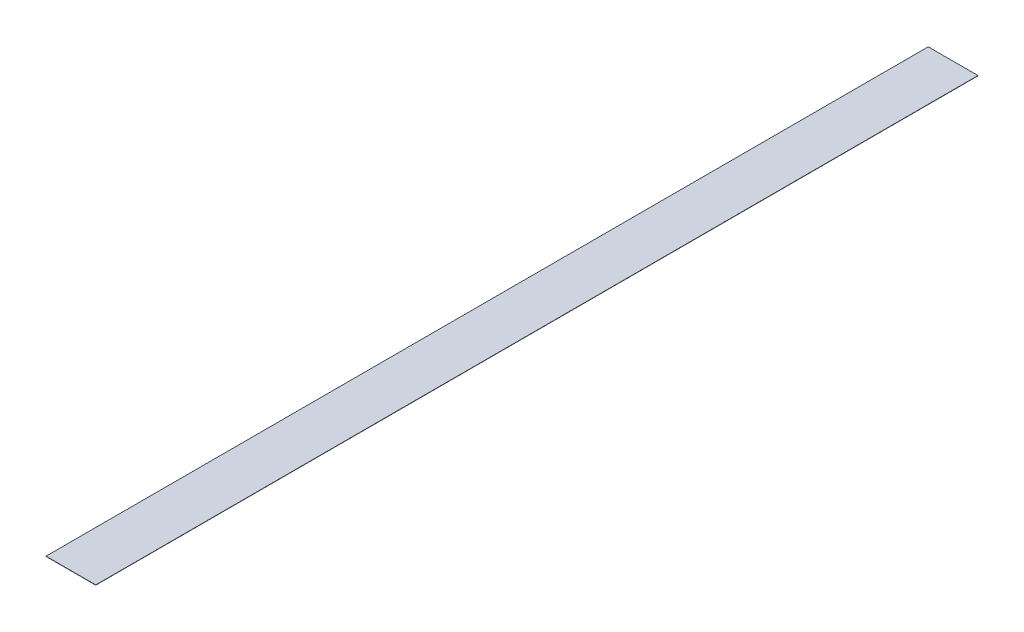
ISO-10303-21;
HEADER;
FILE_DESCRIPTION(('STEP AP214'),'2;1');
FILE_NAME('part.step','',(''),(''),'','','');
FILE_SCHEMA(('AUTOMOTIVE_DESIGN { 1 0 10303 214 1 1 1 1 }'));
ENDSEC;
DATA;
#1=APPLICATION_CONTEXT('core data for automotive mechanical design processes');
#2=APPLICATION_PROTOCOL_DEFINITION('international standard','automotive_design',2000,#1);
#3=PRODUCT_CONTEXT('',#1,'mechanical');
#4=PRODUCT('Part','Part','',(#3));
#5=PRODUCT_RELATED_PRODUCT_CATEGORY('part','',(#4));
#6=PRODUCT_DEFINITION_FORMATION('','',#4);
#7=PRODUCT_DEFINITION_CONTEXT('part definition',#1,'design');
#8=PRODUCT_DEFINITION('design','',#6,#7);
#9=PRODUCT_DEFINITION_SHAPE('','',#8);
#10=(LENGTH_UNIT() NAMED_UNIT(*) SI_UNIT(.MILLI.,.METRE.));
#11=(NAMED_UNIT(*) PLANE_ANGLE_UNIT() SI_UNIT($,.RADIAN.));
#12=(NAMED_UNIT(*) SI_UNIT($,.STERADIAN.) SOLID_ANGLE_UNIT());
#13=UNCERTAINTY_MEASURE_WITH_UNIT(LENGTH_MEASURE(1.E-05),#10,'distance_accuracy_value','');
#14=(GEOMETRIC_REPRESENTATION_CONTEXT(3) GLOBAL_UNCERTAINTY_ASSIGNED_CONTEXT((#13)) GLOBAL_UNIT_ASSIGNED_CONTEXT((#10,
#11,#12)) REPRESENTATION_CONTEXT('',''));
#15=CARTESIAN_POINT('',(0.,0.,0.));
#16=DIRECTION('',(0.,0.,1.));
#17=DIRECTION('',(1.,0.,0.));
#18=AXIS2_PLACEMENT_3D('',#15,#16,#17);
#19=CARTESIAN_POINT('',(23.8125,0.254,422.275));
#20=DIRECTION('',(-1.,0.,0.));
#21=DIRECTION('',(0.,0.,1.));
#22=AXIS2_PLACEMENT_3D('',#19,#20,#21);
#23=PLANE('',#22);
#24=DIRECTION('',(0.,0.,-1.));
#25=VECTOR('',#24,1.);
#26=CARTESIAN_POINT('',(23.8125,0.,422.275));
#27=LINE('',#26,#25);
#28=CARTESIAN_POINT('',(23.8125,0.,422.275));
#29=VERTEX_POINT('',#28);
#30=CARTESIAN_POINT('',(23.8125,0.,-422.275));
#31=VERTEX_POINT('',#30);
#32=EDGE_CURVE('E111',#29,#31,#27,.T.);
#33=ORIENTED_EDGE('',*,*,#32,.T.);
#34=DIRECTION('',(0.,-1.,0.));
#35=VECTOR('',#34,1.);
#36=CARTESIAN_POINT('',(23.8125,0.254,-422.275));
#37=LINE('',#36,#35);
#38=CARTESIAN_POINT('',(23.8125,0.254,-422.275));
#39=VERTEX_POINT('',#38);
#40=EDGE_CURVE('E11',#39,#31,#37,.T.);
#41=ORIENTED_EDGE('',*,*,#40,.F.);
#42=DIRECTION('',(0.,0.,-1.));
#43=VECTOR('',#42,1.);
#44=CARTESIAN_POINT('',(23.8125,0.254,422.275));
#45=LINE('',#44,#43);
#46=CARTESIAN_POINT('',(23.8125,0.254,422.275));
#47=VERTEX_POINT('',#46);
#48=EDGE_CURVE('E95',#47,#39,#45,.T.);
#49=ORIENTED_EDGE('',*,*,#48,.F.);
#50=DIRECTION('',(0.,-1.,0.));
#51=VECTOR('',#50,1.);
#52=CARTESIAN_POINT('',(23.8125,0.254,422.275));
#53=LINE('',#52,#51);
#54=EDGE_CURVE('E107',#47,#29,#53,.T.);
#55=ORIENTED_EDGE('',*,*,#54,.T.);
#56=EDGE_LOOP('',(#33,#41,#49,#55));
#57=FACE_BOUND('',#56,.T.);
#58=ADVANCED_FACE('F43',(#57),#23,.F.);
#59=CARTESIAN_POINT('',(23.8125,0.254,-422.275));
#60=DIRECTION('',(0.,0.,1.));
#61=DIRECTION('',(1.,0.,0.));
#62=AXIS2_PLACEMENT_3D('',#59,#60,#61);
#63=PLANE('',#62);
#64=DIRECTION('',(-1.,0.,0.));
#65=VECTOR('',#64,1.);
#66=CARTESIAN_POINT('',(23.8125,0.,-422.275));
#67=LINE('',#66,#65);
#68=CARTESIAN_POINT('',(-23.8125,0.,-422.275));
#69=VERTEX_POINT('',#68);
#70=EDGE_CURVE('E100',#31,#69,#67,.T.);
#71=ORIENTED_EDGE('',*,*,#70,.T.);
#72=DIRECTION('',(0.,-1.,0.));
#73=VECTOR('',#72,1.);
#74=CARTESIAN_POINT('',(-23.8125,0.254,-422.275));
#75=LINE('',#74,#73);
#76=CARTESIAN_POINT('',(-23.8125,0.254,-422.275));
#77=VERTEX_POINT('',#76);
#78=EDGE_CURVE('E52',#77,#69,#75,.T.);
#79=ORIENTED_EDGE('',*,*,#78,.F.);
#80=DIRECTION('',(-1.,0.,0.));
#81=VECTOR('',#80,1.);
#82=CARTESIAN_POINT('',(23.8125,0.254,-422.275));
#83=LINE('',#82,#81);
#84=EDGE_CURVE('E90',#39,#77,#83,.T.);
#85=ORIENTED_EDGE('',*,*,#84,.F.);
#86=ORIENTED_EDGE('',*,*,#40,.T.);
#87=EDGE_LOOP('',(#71,#79,#85,#86));
#88=FACE_BOUND('',#87,.T.);
#89=ADVANCED_FACE('F99',(#88),#63,.F.);
#90=CARTESIAN_POINT('',(-23.8125,0.254,422.275));
#91=DIRECTION('',(1.,0.,0.));
#92=DIRECTION('',(0.,0.,-1.));
#93=AXIS2_PLACEMENT_3D('',#90,#91,#92);
#94=PLANE('',#93);
#95=DIRECTION('',(0.,0.,1.));
#96=VECTOR('',#95,1.);
#97=CARTESIAN_POINT('',(-23.8125,0.,422.275));
#98=LINE('',#97,#96);
#99=CARTESIAN_POINT('',(-23.8125,0.,422.275));
#100=VERTEX_POINT('',#99);
#101=EDGE_CURVE('E77',#69,#100,#98,.T.);
#102=ORIENTED_EDGE('',*,*,#101,.T.);
#103=DIRECTION('',(0.,-1.,0.));
#104=VECTOR('',#103,1.);
#105=CARTESIAN_POINT('',(-23.8125,0.254,422.275));
#106=LINE('',#105,#104);
#107=CARTESIAN_POINT('',(-23.8125,0.254,422.275));
#108=VERTEX_POINT('',#107);
#109=EDGE_CURVE('E102',#108,#100,#106,.T.);
#110=ORIENTED_EDGE('',*,*,#109,.F.);
#111=DIRECTION('',(0.,0.,1.));
#112=VECTOR('',#111,1.);
#113=CARTESIAN_POINT('',(-23.8125,0.254,422.275));
#114=LINE('',#113,#112);
#115=EDGE_CURVE('E93',#77,#108,#114,.T.);
#116=ORIENTED_EDGE('',*,*,#115,.F.);
#117=ORIENTED_EDGE('',*,*,#78,.T.);
#118=EDGE_LOOP('',(#102,#110,#116,#117));
#119=FACE_BOUND('',#118,.T.);
#120=ADVANCED_FACE('F103',(#119),#94,.F.);
#121=CARTESIAN_POINT('',(23.8125,0.254,422.275));
#122=DIRECTION('',(0.,0.,-1.));
#123=DIRECTION('',(-1.,0.,0.));
#124=AXIS2_PLACEMENT_3D('',#121,#122,#123);
#125=PLANE('',#124);
#126=DIRECTION('',(1.,0.,0.));
#127=VECTOR('',#126,1.);
#128=CARTESIAN_POINT('',(23.8125,0.,422.275));
#129=LINE('',#128,#127);
#130=EDGE_CURVE('E83',#100,#29,#129,.T.);
#131=ORIENTED_EDGE('',*,*,#130,.T.);
#132=ORIENTED_EDGE('',*,*,#54,.F.);
#133=DIRECTION('',(1.,0.,0.));
#134=VECTOR('',#133,1.);
#135=CARTESIAN_POINT('',(23.8125,0.254,422.275));
#136=LINE('',#135,#134);
#137=EDGE_CURVE('E60',#108,#47,#136,.T.);
#138=ORIENTED_EDGE('',*,*,#137,.F.);
#139=ORIENTED_EDGE('',*,*,#109,.T.);
#140=EDGE_LOOP('',(#131,#132,#138,#139));
#141=FACE_BOUND('',#140,.T.);
#142=ADVANCED_FACE('F124',(#141),#125,.F.);
#143=CARTESIAN_POINT('',(0.,0.254,0.));
#144=DIRECTION('',(0.,1.,0.));
#145=DIRECTION('',(0.,0.,1.));
#146=AXIS2_PLACEMENT_3D('',#143,#144,#145);
#147=PLANE('',#146);
#148=ORIENTED_EDGE('',*,*,#48,.T.);
#149=ORIENTED_EDGE('',*,*,#84,.T.);
#150=ORIENTED_EDGE('',*,*,#115,.T.);
#151=ORIENTED_EDGE('',*,*,#137,.T.);
#152=EDGE_LOOP('',(#148,#149,#150,#151));
#153=FACE_BOUND('',#152,.T.);
#154=ADVANCED_FACE('F91',(#153),#147,.T.);
#155=CARTESIAN_POINT('',(0.,0.,0.));
#156=DIRECTION('',(0.,1.,0.));
#157=DIRECTION('',(0.,0.,1.));
#158=AXIS2_PLACEMENT_3D('',#155,#156,#157);
#159=PLANE('',#158);
#160=ORIENTED_EDGE('',*,*,#32,.F.);
#161=ORIENTED_EDGE('',*,*,#130,.F.);
#162=ORIENTED_EDGE('',*,*,#101,.F.);
#163=ORIENTED_EDGE('',*,*,#70,.F.);
#164=EDGE_LOOP('',(#160,#161,#162,#163));
#165=FACE_BOUND('',#164,.T.);
#166=ADVANCED_FACE('F127',(#165),#159,.F.);
#167=CLOSED_SHELL('',(#58,#89,#120,#142,#154,#166));
#168=MANIFOLD_SOLID_BREP('B2',#167);
#169=ADVANCED_BREP_SHAPE_REPRESENTATION('',(#18,#168),#14);
#170=SHAPE_DEFINITION_REPRESENTATION(#9,#169);
ENDSEC;
END-ISO-10303-21;
